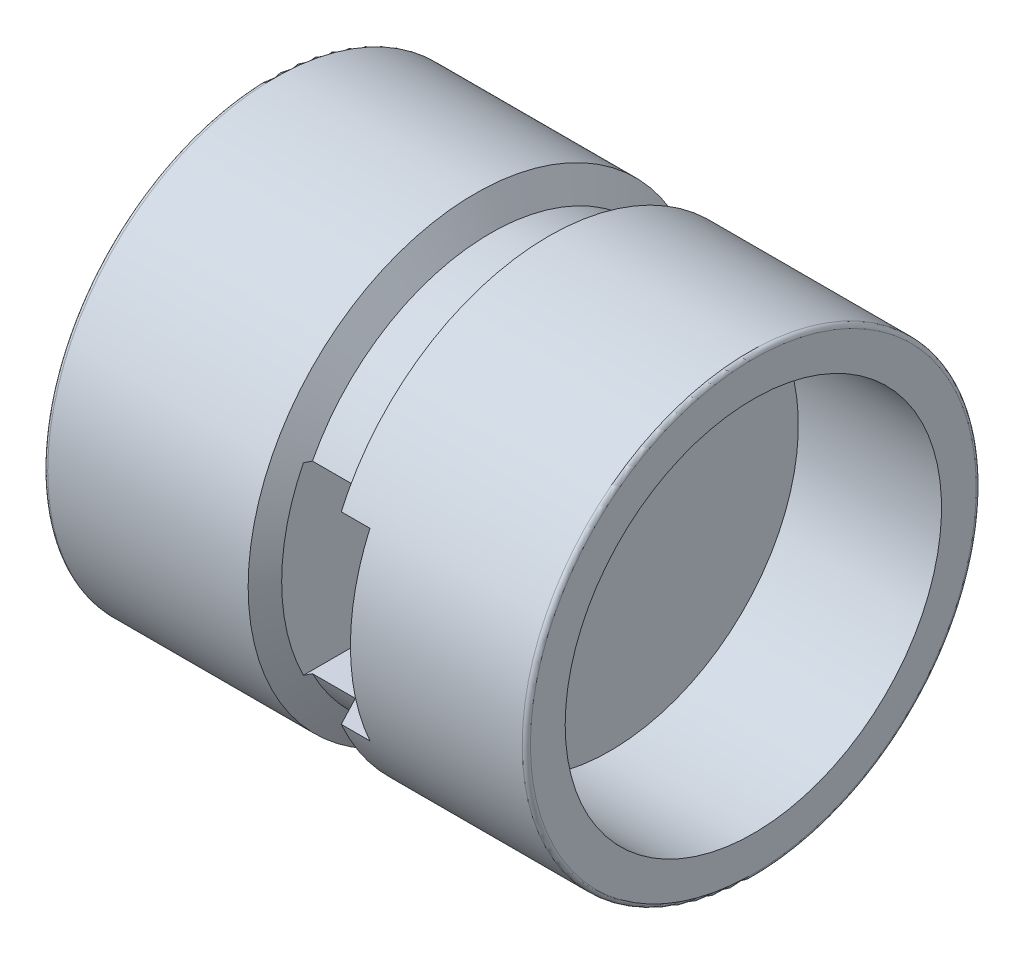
from build123d import *

# Parameters (mm, degrees)
SKIZZE2_W                       = 2.2
SKIZZE2_H                       = 4.5
SCHNITT_LINEAR_AUSTRAGEN1_DEPTH = 7
SKIZZE2_2_W                     = 2.2
SKIZZE2_2_H                     = 4.5
SCHNITT_LINEAR_AUSTRAGEN2_DEPTH = 7
SCHNITT_LINEAR_AUSTRAGEN3_DEPTH = 4
VERRUNDUNG1_R                   = 0.1
VERRUNDUNG2_R                   = 0.1


with BuildPart() as part:
    # Skizze1 → Rotation1 (revolve)
    with BuildSketch(Plane.XY, mode=Mode.PRIVATE) as rotation1_sk:
        Polygon((-8.618203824, 1.65), (-2.118203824, 1.65), (-2.118203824, 3.75), (-0.618203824, 3.75), (-0.618203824, 0), (-0.318203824, 0), (-0.318203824, 4.6), (3.181796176, 4.6), (3.181796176, 5.55), (-1.818203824, 5.55), (-2.193481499, 4.9), (-3.242926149, 4.9), (-3.618203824, 5.55), (-8.618203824, 5.55), (-8.618203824, 4.6), (-4.718203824, 4.6), (-4.718203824, 2.75), (-8.618203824, 2.75), align=None)
    revolve(rotation1_sk.sketch.rotate(Axis((0, 0, 0), (1, 0, 0)), 90), axis=Axis((0, 0, 0), (1, 0, 0)))

    # Skizze2 → Schnitt-Linear austragen1 (cut)
    with BuildSketch(Plane.XY):
        with Locations((-2.218203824, 0)):
            Rectangle(SKIZZE2_W, SKIZZE2_H)
    extrude(amount=SCHNITT_LINEAR_AUSTRAGEN1_DEPTH, mode=Mode.SUBTRACT)

    # Skizze2_2 → Schnitt-Linear austragen2 (cut)
    with BuildSketch(Plane.XY):
        with Locations((-2.218203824, 0)):
            Rectangle(SKIZZE2_2_W, SKIZZE2_2_H)
    extrude(amount=-SCHNITT_LINEAR_AUSTRAGEN2_DEPTH, mode=Mode.SUBTRACT)

    # Skizze3 → Schnitt-Linear austragen3 (cut)
    with BuildSketch(Plane.ZY.offset(8.618203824)):
        with BuildLine():
            Line((-0.7, 1.979898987), (-0.7, 0.7))
            Line((-0.7, 0.7), (-1.979898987, 0.7))
            ThreePointArc((-1.979898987, 0.7), (-2.1, 0), (-1.979898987, -0.7))
            Line((-1.979898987, -0.7), (-0.7, -0.7))
            Line((-0.7, -0.7), (-0.7, -1.979898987))
            ThreePointArc((-0.7, -1.979898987), (0, -2.1), (0.7, -1.979898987))
            Line((0.7, -1.979898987), (0.7, -0.7))
            Line((0.7, -0.7), (1.979898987, -0.7))
            ThreePointArc((1.979898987, -0.7), (2.1, 0), (1.979898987, 0.7))
            Line((1.979898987, 0.7), (0.7, 0.7))
            Line((0.7, 0.7), (0.7, 1.979898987))
            ThreePointArc((0.7, 1.979898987), (0, 2.1), (-0.7, 1.979898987))
        make_face()
    extrude(amount=-SCHNITT_LINEAR_AUSTRAGEN3_DEPTH, mode=Mode.SUBTRACT)

    # Verrundung1
    verrundung1_edges = [part.edges().sort_by_distance(p)[0] for p in [
        (-8.618203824, 0, -5.55),
    ]]
    fillet(verrundung1_edges, radius=VERRUNDUNG1_R)

    # Verrundung2
    verrundung2_edges = [part.edges().sort_by_distance(p)[0] for p in [
        (3.181796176, 0, -5.55),
    ]]
    fillet(verrundung2_edges, radius=VERRUNDUNG2_R)


solid = part.part
